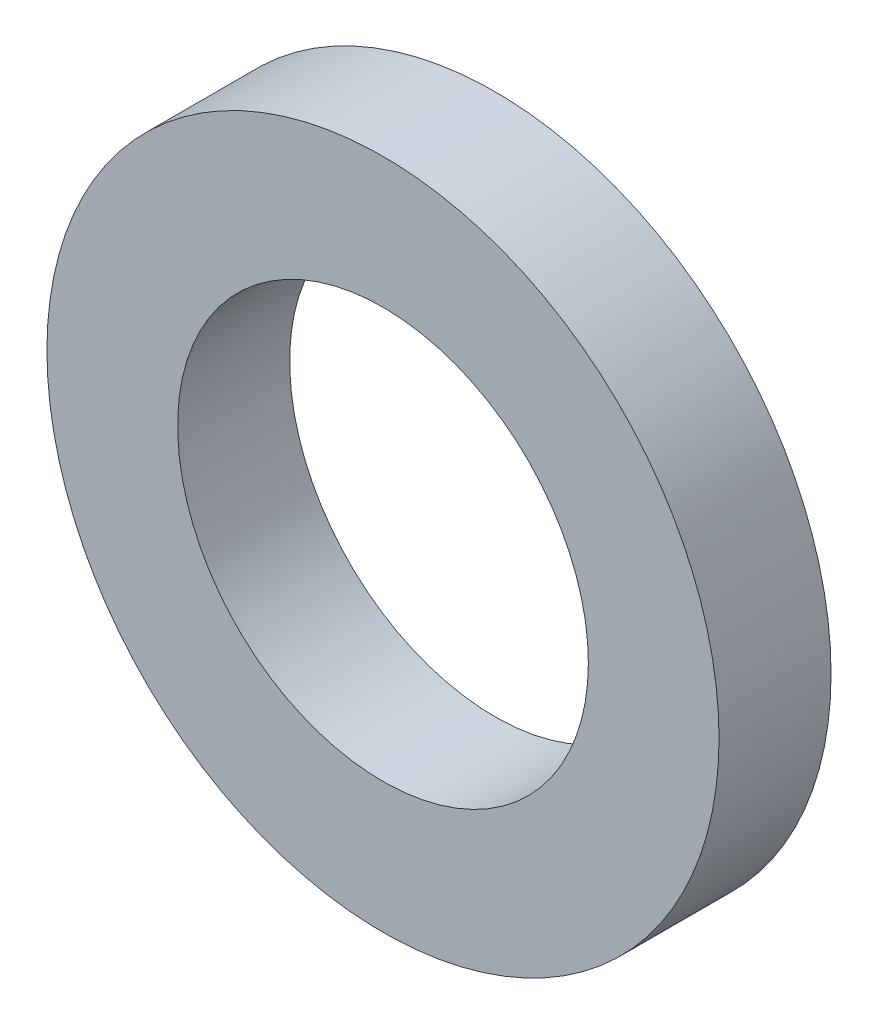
from build123d import *

# Parameters (mm, degrees)
ESQUISSE1_R             = 4.5
BASE_EXTRUSION_DEPTH    = 1.5
ESQUISSE2_R             = 2.75
ENL_V_MAT_EXTRU_1_DEPTH = 7.538348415


with BuildPart() as part:
    # Esquisse1 → Base-Extrusion (new body)
    with BuildSketch(Plane.XY):
        Circle(ESQUISSE1_R)
    extrude(amount=BASE_EXTRUSION_DEPTH)

    # Esquisse2 → Enl_v. mat.-Extru.1 (cut, through all)
    with BuildSketch(Plane.XY.offset(1.5)):
        Circle(ESQUISSE2_R)
    extrude(amount=-ENL_V_MAT_EXTRU_1_DEPTH, mode=Mode.SUBTRACT)


solid = part.part
